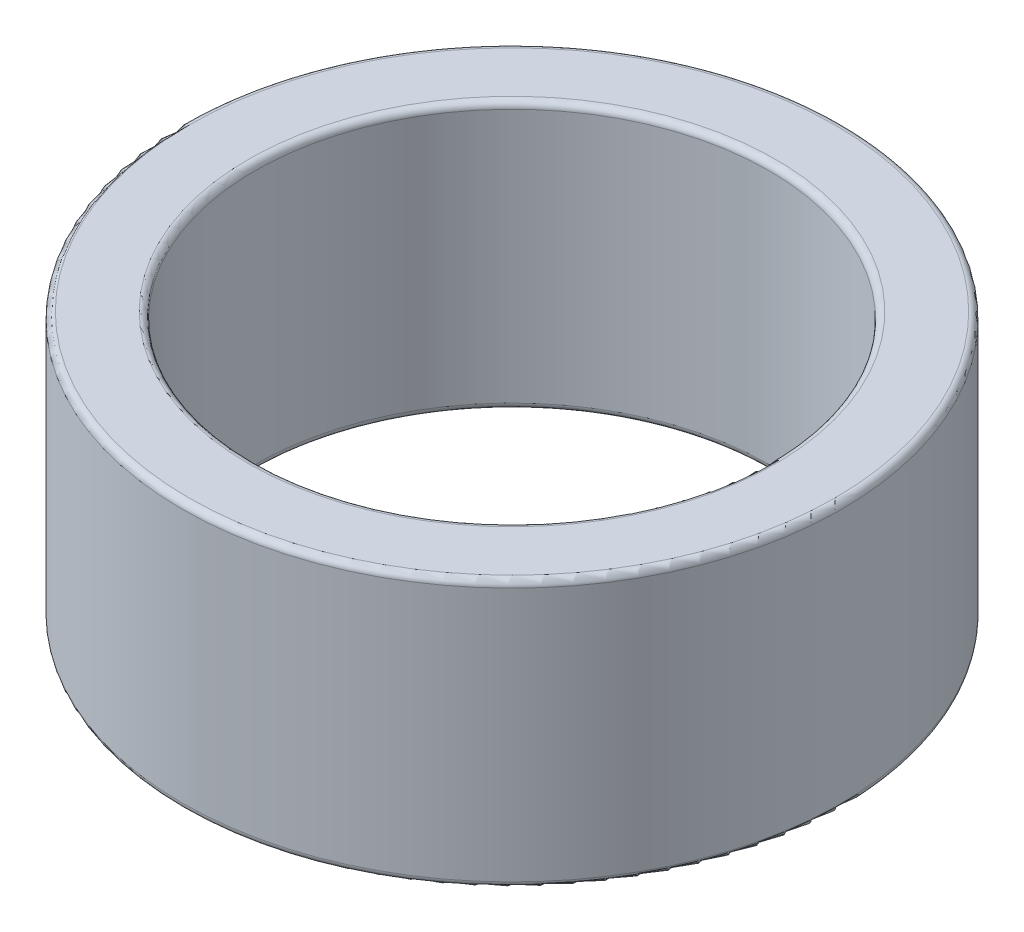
from build123d import *

# Parameters (mm, degrees)
SKETCH1_R          = 12.7
EXTRUDE1_DEPTH     = 10.3124
SKETCH2_R          = 9.906
CUT_EXTRUDE1_DEPTH = 21.710518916
FILLET1_R          = 0.254


with BuildPart() as part:
    # Sketch1 → Extrude1 (new body)
    with BuildSketch(Plane(origin=(0, 0, 0), x_dir=(1, 0, 0), z_dir=(0, 1, 0))):
        with Locations(Location((0, 0, 0), (0, 0, 270))):
            Circle(SKETCH1_R)
    extrude(amount=EXTRUDE1_DEPTH)

    # Sketch2 → Cut-Extrude1 (cut, through all)
    with BuildSketch(Plane.XZ):
        with Locations(Location((0, 0, 0), (0, 0, 270))):
            Circle(SKETCH2_R)
    extrude(amount=-CUT_EXTRUDE1_DEPTH, mode=Mode.SUBTRACT)

    # Fillet1
    fillet1_edges = [part.edges().sort_by_distance(p)[0] for p in [
        (0, 0, -12.7),
        (0, 10.3124, -12.7),
        (0, 10.3124, 9.906),
        (0, 0, 9.906),
    ]]
    fillet(fillet1_edges, radius=FILLET1_R)


solid = part.part
